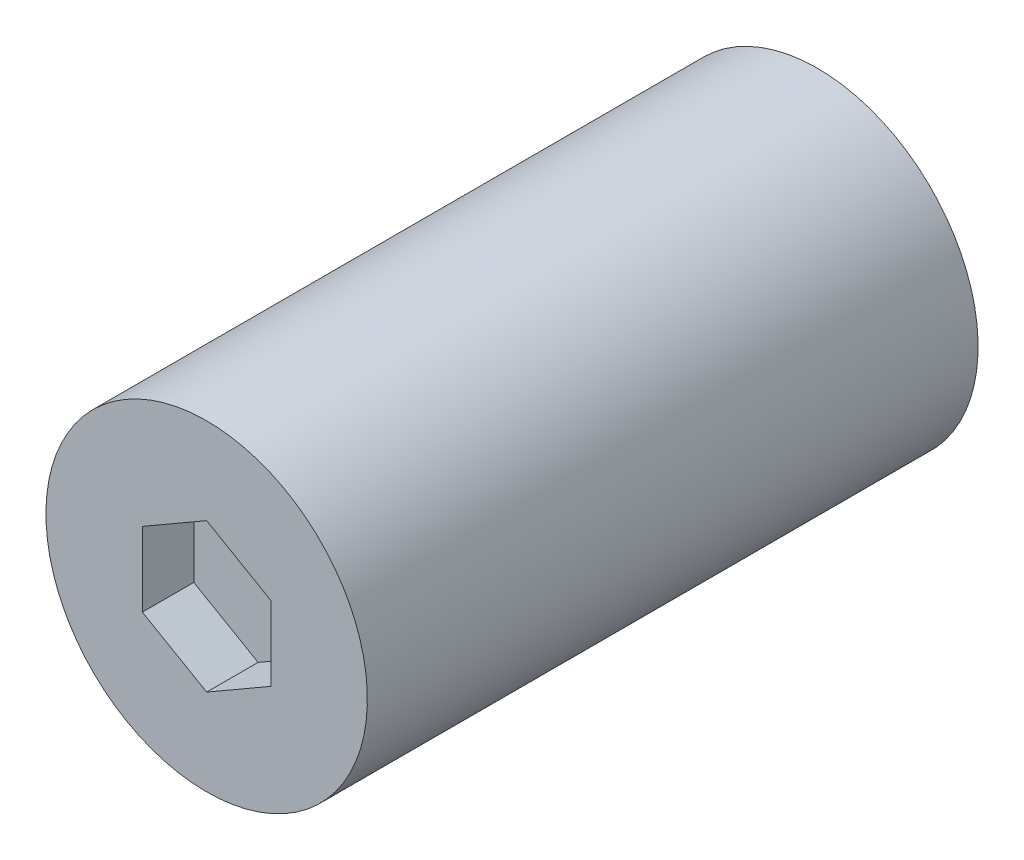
ISO-10303-21;
HEADER;
FILE_DESCRIPTION(('STEP AP214'),'2;1');
FILE_NAME('part.step','',(''),(''),'','','');
FILE_SCHEMA(('AUTOMOTIVE_DESIGN { 1 0 10303 214 1 1 1 1 }'));
ENDSEC;
DATA;
#1=APPLICATION_CONTEXT('core data for automotive mechanical design processes');
#2=APPLICATION_PROTOCOL_DEFINITION('international standard','automotive_design',2000,#1);
#3=PRODUCT_CONTEXT('',#1,'mechanical');
#4=PRODUCT('Part','Part','',(#3));
#5=PRODUCT_RELATED_PRODUCT_CATEGORY('part','',(#4));
#6=PRODUCT_DEFINITION_FORMATION('','',#4);
#7=PRODUCT_DEFINITION_CONTEXT('part definition',#1,'design');
#8=PRODUCT_DEFINITION('design','',#6,#7);
#9=PRODUCT_DEFINITION_SHAPE('','',#8);
#10=(LENGTH_UNIT() NAMED_UNIT(*) SI_UNIT(.MILLI.,.METRE.));
#11=(NAMED_UNIT(*) PLANE_ANGLE_UNIT() SI_UNIT($,.RADIAN.));
#12=(NAMED_UNIT(*) SI_UNIT($,.STERADIAN.) SOLID_ANGLE_UNIT());
#13=UNCERTAINTY_MEASURE_WITH_UNIT(LENGTH_MEASURE(1.E-05),#10,'distance_accuracy_value','');
#14=(GEOMETRIC_REPRESENTATION_CONTEXT(3) GLOBAL_UNCERTAINTY_ASSIGNED_CONTEXT((#13)) GLOBAL_UNIT_ASSIGNED_CONTEXT((#10,
#11,#12)) REPRESENTATION_CONTEXT('',''));
#15=CARTESIAN_POINT('',(0.,0.,0.));
#16=DIRECTION('',(0.,0.,1.));
#17=DIRECTION('',(1.,0.,0.));
#18=AXIS2_PLACEMENT_3D('',#15,#16,#17);
#19=CARTESIAN_POINT('',(0.,0.,38.));
#20=DIRECTION('',(0.,0.,-1.));
#21=DIRECTION('',(0.5,0.866025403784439,0.));
#22=AXIS2_PLACEMENT_3D('',#19,#20,#21);
#23=CYLINDRICAL_SURFACE('',#22,10.);
#24=CARTESIAN_POINT('',(0.,0.,38.));
#25=DIRECTION('',(0.,0.,1.));
#26=DIRECTION('',(-0.5,-0.866025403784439,0.));
#27=AXIS2_PLACEMENT_3D('',#24,#25,#26);
#28=CIRCLE('',#27,10.);
#29=CARTESIAN_POINT('',(-5.,-8.66025403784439,38.));
#30=VERTEX_POINT('',#29);
#31=EDGE_CURVE('E9',#30,#30,#28,.T.);
#32=ORIENTED_EDGE('',*,*,#31,.F.);
#33=EDGE_LOOP('',(#32));
#34=FACE_BOUND('',#33,.T.);
#35=CARTESIAN_POINT('',(0.,0.,0.));
#36=DIRECTION('',(0.,0.,-1.));
#37=DIRECTION('',(-0.866025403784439,0.5,0.));
#38=AXIS2_PLACEMENT_3D('',#35,#36,#37);
#39=CIRCLE('',#38,10.);
#40=CARTESIAN_POINT('',(-8.66025403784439,5.,0.));
#41=VERTEX_POINT('',#40);
#42=EDGE_CURVE('E128',#41,#41,#39,.T.);
#43=ORIENTED_EDGE('',*,*,#42,.F.);
#44=EDGE_LOOP('',(#43));
#45=FACE_BOUND('',#44,.T.);
#46=ADVANCED_FACE('F14',(#34,#45),#23,.T.);
#47=CARTESIAN_POINT('',(0.,0.,38.));
#48=DIRECTION('',(0.,0.,1.));
#49=DIRECTION('',(-0.5,-0.866025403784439,0.));
#50=AXIS2_PLACEMENT_3D('',#47,#48,#49);
#51=PLANE('',#50);
#52=DIRECTION('',(0.866025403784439,0.5,0.));
#53=VECTOR('',#52,1.);
#54=CARTESIAN_POINT('',(0.,-4.61880215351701,38.));
#55=LINE('',#54,#53);
#56=CARTESIAN_POINT('',(0.,-4.61880215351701,38.));
#57=VERTEX_POINT('',#56);
#58=CARTESIAN_POINT('',(4.,-2.30940107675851,38.));
#59=VERTEX_POINT('',#58);
#60=EDGE_CURVE('E28',#57,#59,#55,.T.);
#61=ORIENTED_EDGE('',*,*,#60,.F.);
#62=DIRECTION('',(0.866025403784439,-0.5,0.));
#63=VECTOR('',#62,1.);
#64=CARTESIAN_POINT('',(-4.,-2.3094010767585,38.));
#65=LINE('',#64,#63);
#66=CARTESIAN_POINT('',(-4.,-2.3094010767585,38.));
#67=VERTEX_POINT('',#66);
#68=EDGE_CURVE('E97',#67,#57,#65,.T.);
#69=ORIENTED_EDGE('',*,*,#68,.F.);
#70=DIRECTION('',(0.,-1.,0.));
#71=VECTOR('',#70,1.);
#72=CARTESIAN_POINT('',(-4.,2.30940107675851,38.));
#73=LINE('',#72,#71);
#74=CARTESIAN_POINT('',(-4.,2.30940107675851,38.));
#75=VERTEX_POINT('',#74);
#76=EDGE_CURVE('E91',#75,#67,#73,.T.);
#77=ORIENTED_EDGE('',*,*,#76,.F.);
#78=DIRECTION('',(-0.866025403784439,-0.5,0.));
#79=VECTOR('',#78,1.);
#80=CARTESIAN_POINT('',(0.,4.61880215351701,38.));
#81=LINE('',#80,#79);
#82=CARTESIAN_POINT('',(0.,4.61880215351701,38.));
#83=VERTEX_POINT('',#82);
#84=EDGE_CURVE('E89',#83,#75,#81,.T.);
#85=ORIENTED_EDGE('',*,*,#84,.F.);
#86=DIRECTION('',(-0.866025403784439,0.5,0.));
#87=VECTOR('',#86,1.);
#88=CARTESIAN_POINT('',(4.,2.3094010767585,38.));
#89=LINE('',#88,#87);
#90=CARTESIAN_POINT('',(4.,2.3094010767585,38.));
#91=VERTEX_POINT('',#90);
#92=EDGE_CURVE('E70',#91,#83,#89,.T.);
#93=ORIENTED_EDGE('',*,*,#92,.F.);
#94=DIRECTION('',(0.,1.,0.));
#95=VECTOR('',#94,1.);
#96=CARTESIAN_POINT('',(4.,-2.30940107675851,38.));
#97=LINE('',#96,#95);
#98=EDGE_CURVE('E81',#59,#91,#97,.T.);
#99=ORIENTED_EDGE('',*,*,#98,.F.);
#100=EDGE_LOOP('',(#61,#69,#77,#85,#93,#99));
#101=FACE_BOUND('',#100,.T.);
#102=ORIENTED_EDGE('',*,*,#31,.T.);
#103=EDGE_LOOP('',(#102));
#104=FACE_BOUND('',#103,.T.);
#105=ADVANCED_FACE('F85',(#101,#104),#51,.T.);
#106=CARTESIAN_POINT('',(0.,-4.61880215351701,34.8));
#107=DIRECTION('',(0.5,-0.866025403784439,0.));
#108=DIRECTION('',(0.866025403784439,0.5,0.));
#109=AXIS2_PLACEMENT_3D('',#106,#107,#108);
#110=PLANE('',#109);
#111=ORIENTED_EDGE('',*,*,#60,.T.);
#112=DIRECTION('',(0.,0.,1.));
#113=VECTOR('',#112,1.);
#114=CARTESIAN_POINT('',(4.,-2.30940107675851,34.8));
#115=LINE('',#114,#113);
#116=CARTESIAN_POINT('',(4.,-2.30940107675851,34.8));
#117=VERTEX_POINT('',#116);
#118=EDGE_CURVE('E78',#117,#59,#115,.T.);
#119=ORIENTED_EDGE('',*,*,#118,.F.);
#120=DIRECTION('',(0.866025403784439,0.5,0.));
#121=VECTOR('',#120,1.);
#122=CARTESIAN_POINT('',(0.,-4.61880215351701,34.8));
#123=LINE('',#122,#121);
#124=CARTESIAN_POINT('',(0.,-4.61880215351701,34.8));
#125=VERTEX_POINT('',#124);
#126=EDGE_CURVE('E99',#125,#117,#123,.T.);
#127=ORIENTED_EDGE('',*,*,#126,.F.);
#128=DIRECTION('',(0.,0.,1.));
#129=VECTOR('',#128,1.);
#130=CARTESIAN_POINT('',(0.,-4.61880215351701,34.8));
#131=LINE('',#130,#129);
#132=EDGE_CURVE('E21',#125,#57,#131,.T.);
#133=ORIENTED_EDGE('',*,*,#132,.T.);
#134=EDGE_LOOP('',(#111,#119,#127,#133));
#135=FACE_BOUND('',#134,.T.);
#136=ADVANCED_FACE('F125',(#135),#110,.F.);
#137=CARTESIAN_POINT('',(-4.,-2.3094010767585,34.8));
#138=DIRECTION('',(-0.5,-0.866025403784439,0.));
#139=DIRECTION('',(0.866025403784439,-0.5,0.));
#140=AXIS2_PLACEMENT_3D('',#137,#138,#139);
#141=PLANE('',#140);
#142=ORIENTED_EDGE('',*,*,#68,.T.);
#143=ORIENTED_EDGE('',*,*,#132,.F.);
#144=DIRECTION('',(0.866025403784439,-0.5,0.));
#145=VECTOR('',#144,1.);
#146=CARTESIAN_POINT('',(-4.,-2.3094010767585,34.8));
#147=LINE('',#146,#145);
#148=CARTESIAN_POINT('',(-4.,-2.3094010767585,34.8));
#149=VERTEX_POINT('',#148);
#150=EDGE_CURVE('E111',#149,#125,#147,.T.);
#151=ORIENTED_EDGE('',*,*,#150,.F.);
#152=DIRECTION('',(0.,0.,1.));
#153=VECTOR('',#152,1.);
#154=CARTESIAN_POINT('',(-4.,-2.3094010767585,34.8));
#155=LINE('',#154,#153);
#156=EDGE_CURVE('E115',#149,#67,#155,.T.);
#157=ORIENTED_EDGE('',*,*,#156,.T.);
#158=EDGE_LOOP('',(#142,#143,#151,#157));
#159=FACE_BOUND('',#158,.T.);
#160=ADVANCED_FACE('F127',(#159),#141,.F.);
#161=CARTESIAN_POINT('',(-4.,2.30940107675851,34.8));
#162=DIRECTION('',(-1.,0.,0.));
#163=DIRECTION('',(0.,-1.,0.));
#164=AXIS2_PLACEMENT_3D('',#161,#162,#163);
#165=PLANE('',#164);
#166=ORIENTED_EDGE('',*,*,#76,.T.);
#167=ORIENTED_EDGE('',*,*,#156,.F.);
#168=DIRECTION('',(0.,-1.,0.));
#169=VECTOR('',#168,1.);
#170=CARTESIAN_POINT('',(-4.,2.30940107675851,34.8));
#171=LINE('',#170,#169);
#172=CARTESIAN_POINT('',(-4.,2.30940107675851,34.8));
#173=VERTEX_POINT('',#172);
#174=EDGE_CURVE('E108',#173,#149,#171,.T.);
#175=ORIENTED_EDGE('',*,*,#174,.F.);
#176=DIRECTION('',(0.,0.,1.));
#177=VECTOR('',#176,1.);
#178=CARTESIAN_POINT('',(-4.,2.30940107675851,34.8));
#179=LINE('',#178,#177);
#180=EDGE_CURVE('E117',#173,#75,#179,.T.);
#181=ORIENTED_EDGE('',*,*,#180,.T.);
#182=EDGE_LOOP('',(#166,#167,#175,#181));
#183=FACE_BOUND('',#182,.T.);
#184=ADVANCED_FACE('F155',(#183),#165,.F.);
#185=CARTESIAN_POINT('',(0.,4.61880215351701,34.8));
#186=DIRECTION('',(-0.5,0.866025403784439,0.));
#187=DIRECTION('',(-0.866025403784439,-0.5,0.));
#188=AXIS2_PLACEMENT_3D('',#185,#186,#187);
#189=PLANE('',#188);
#190=ORIENTED_EDGE('',*,*,#84,.T.);
#191=ORIENTED_EDGE('',*,*,#180,.F.);
#192=DIRECTION('',(-0.866025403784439,-0.5,0.));
#193=VECTOR('',#192,1.);
#194=CARTESIAN_POINT('',(0.,4.61880215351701,34.8));
#195=LINE('',#194,#193);
#196=CARTESIAN_POINT('',(0.,4.61880215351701,34.8));
#197=VERTEX_POINT('',#196);
#198=EDGE_CURVE('E105',#197,#173,#195,.T.);
#199=ORIENTED_EDGE('',*,*,#198,.F.);
#200=DIRECTION('',(0.,0.,1.));
#201=VECTOR('',#200,1.);
#202=CARTESIAN_POINT('',(0.,4.61880215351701,34.8));
#203=LINE('',#202,#201);
#204=EDGE_CURVE('E77',#197,#83,#203,.T.);
#205=ORIENTED_EDGE('',*,*,#204,.T.);
#206=EDGE_LOOP('',(#190,#191,#199,#205));
#207=FACE_BOUND('',#206,.T.);
#208=ADVANCED_FACE('F121',(#207),#189,.F.);
#209=CARTESIAN_POINT('',(4.,2.3094010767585,34.8));
#210=DIRECTION('',(0.5,0.866025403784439,0.));
#211=DIRECTION('',(-0.866025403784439,0.5,0.));
#212=AXIS2_PLACEMENT_3D('',#209,#210,#211);
#213=PLANE('',#212);
#214=ORIENTED_EDGE('',*,*,#92,.T.);
#215=ORIENTED_EDGE('',*,*,#204,.F.);
#216=DIRECTION('',(-0.866025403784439,0.5,0.));
#217=VECTOR('',#216,1.);
#218=CARTESIAN_POINT('',(4.,2.3094010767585,34.8));
#219=LINE('',#218,#217);
#220=CARTESIAN_POINT('',(4.,2.3094010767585,34.8));
#221=VERTEX_POINT('',#220);
#222=EDGE_CURVE('E73',#221,#197,#219,.T.);
#223=ORIENTED_EDGE('',*,*,#222,.F.);
#224=DIRECTION('',(0.,0.,1.));
#225=VECTOR('',#224,1.);
#226=CARTESIAN_POINT('',(4.,2.3094010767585,34.8));
#227=LINE('',#226,#225);
#228=EDGE_CURVE('E66',#221,#91,#227,.T.);
#229=ORIENTED_EDGE('',*,*,#228,.T.);
#230=EDGE_LOOP('',(#214,#215,#223,#229));
#231=FACE_BOUND('',#230,.T.);
#232=ADVANCED_FACE('F68',(#231),#213,.F.);
#233=CARTESIAN_POINT('',(4.,-2.30940107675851,34.8));
#234=DIRECTION('',(1.,0.,0.));
#235=DIRECTION('',(0.,1.,0.));
#236=AXIS2_PLACEMENT_3D('',#233,#234,#235);
#237=PLANE('',#236);
#238=ORIENTED_EDGE('',*,*,#98,.T.);
#239=ORIENTED_EDGE('',*,*,#228,.F.);
#240=DIRECTION('',(0.,1.,0.));
#241=VECTOR('',#240,1.);
#242=CARTESIAN_POINT('',(4.,-2.30940107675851,34.8));
#243=LINE('',#242,#241);
#244=EDGE_CURVE('E102',#117,#221,#243,.T.);
#245=ORIENTED_EDGE('',*,*,#244,.F.);
#246=ORIENTED_EDGE('',*,*,#118,.T.);
#247=EDGE_LOOP('',(#238,#239,#245,#246));
#248=FACE_BOUND('',#247,.T.);
#249=ADVANCED_FACE('F82',(#248),#237,.F.);
#250=CARTESIAN_POINT('',(8.,0.,34.8));
#251=DIRECTION('',(0.,0.,1.));
#252=DIRECTION('',(-0.5,-0.866025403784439,0.));
#253=AXIS2_PLACEMENT_3D('',#250,#251,#252);
#254=PLANE('',#253);
#255=ORIENTED_EDGE('',*,*,#126,.T.);
#256=ORIENTED_EDGE('',*,*,#244,.T.);
#257=ORIENTED_EDGE('',*,*,#222,.T.);
#258=ORIENTED_EDGE('',*,*,#198,.T.);
#259=ORIENTED_EDGE('',*,*,#174,.T.);
#260=ORIENTED_EDGE('',*,*,#150,.T.);
#261=EDGE_LOOP('',(#255,#256,#257,#258,#259,#260));
#262=FACE_BOUND('',#261,.T.);
#263=ADVANCED_FACE('F124',(#262),#254,.T.);
#264=CARTESIAN_POINT('',(0.,0.,0.));
#265=DIRECTION('',(0.,0.,-1.));
#266=DIRECTION('',(-0.866025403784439,0.5,0.));
#267=AXIS2_PLACEMENT_3D('',#264,#265,#266);
#268=PLANE('',#267);
#269=ORIENTED_EDGE('',*,*,#42,.T.);
#270=EDGE_LOOP('',(#269));
#271=FACE_BOUND('',#270,.T.);
#272=ADVANCED_FACE('F133',(#271),#268,.T.);
#273=CLOSED_SHELL('',(#46,#105,#136,#160,#184,#208,#232,#249,#263,#272));
#274=MANIFOLD_SOLID_BREP('B1',#273);
#275=ADVANCED_BREP_SHAPE_REPRESENTATION('',(#18,#274),#14);
#276=SHAPE_DEFINITION_REPRESENTATION(#9,#275);
ENDSEC;
END-ISO-10303-21;
